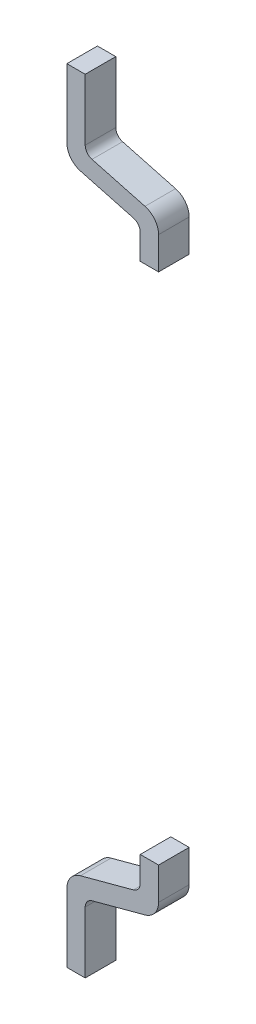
ISO-10303-21;
HEADER;
FILE_DESCRIPTION(('STEP AP214'),'2;1');
FILE_NAME('part.step','',(''),(''),'','','');
FILE_SCHEMA(('AUTOMOTIVE_DESIGN { 1 0 10303 214 1 1 1 1 }'));
ENDSEC;
DATA;
#1=APPLICATION_CONTEXT('core data for automotive mechanical design processes');
#2=APPLICATION_PROTOCOL_DEFINITION('international standard','automotive_design',2000,#1);
#3=PRODUCT_CONTEXT('',#1,'mechanical');
#4=PRODUCT('Part','Part','',(#3));
#5=PRODUCT_RELATED_PRODUCT_CATEGORY('part','',(#4));
#6=PRODUCT_DEFINITION_FORMATION('','',#4);
#7=PRODUCT_DEFINITION_CONTEXT('part definition',#1,'design');
#8=PRODUCT_DEFINITION('design','',#6,#7);
#9=PRODUCT_DEFINITION_SHAPE('','',#8);
#10=(LENGTH_UNIT() NAMED_UNIT(*) SI_UNIT(.MILLI.,.METRE.));
#11=(NAMED_UNIT(*) PLANE_ANGLE_UNIT() SI_UNIT($,.RADIAN.));
#12=(NAMED_UNIT(*) SI_UNIT($,.STERADIAN.) SOLID_ANGLE_UNIT());
#13=UNCERTAINTY_MEASURE_WITH_UNIT(LENGTH_MEASURE(1.E-05),#10,'distance_accuracy_value','');
#14=(GEOMETRIC_REPRESENTATION_CONTEXT(3) GLOBAL_UNCERTAINTY_ASSIGNED_CONTEXT((#13)) GLOBAL_UNIT_ASSIGNED_CONTEXT((#10,
#11,#12)) REPRESENTATION_CONTEXT('',''));
#15=CARTESIAN_POINT('',(0.,0.,0.));
#16=DIRECTION('',(0.,0.,1.));
#17=DIRECTION('',(1.,0.,0.));
#18=AXIS2_PLACEMENT_3D('',#15,#16,#17);
#19=CARTESIAN_POINT('',(0.319072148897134,-2.61868112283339,-3.45));
#20=DIRECTION('',(0.,0.,-1.));
#21=DIRECTION('',(-1.,0.,0.));
#22=AXIS2_PLACEMENT_3D('',#19,#20,#21);
#23=PLANE('',#22);
#24=DIRECTION('',(0.,1.,0.));
#25=VECTOR('',#24,1.);
#26=CARTESIAN_POINT('',(0.6,-2.30668096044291,-3.45));
#27=LINE('',#26,#25);
#28=CARTESIAN_POINT('',(0.6,-2.1,-3.45));
#29=VERTEX_POINT('',#28);
#30=CARTESIAN_POINT('',(0.6,-2.30668096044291,-3.45));
#31=VERTEX_POINT('',#30);
#32=EDGE_CURVE('P0_E125',#29,#31,#27,.F.);
#33=ORIENTED_EDGE('',*,*,#32,.T.);
#34=CARTESIAN_POINT('',(0.525,-2.30668096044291,-3.45));
#35=DIRECTION('',(0.,0.,-1.));
#36=DIRECTION('',(-1.,0.,0.));
#37=AXIS2_PLACEMENT_3D('',#34,#35,#36);
#38=CIRCLE('',#37,0.075);
#39=CARTESIAN_POINT('',(0.544411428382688,-2.37912539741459,-3.45));
#40=VERTEX_POINT('',#39);
#41=EDGE_CURVE('P0_E150',#31,#40,#38,.T.);
#42=ORIENTED_EDGE('',*,*,#41,.T.);
#43=DIRECTION('',(0.965925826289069,0.258819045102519,0.));
#44=VECTOR('',#43,1.);
#45=CARTESIAN_POINT('',(0.111177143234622,-2.49521017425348,-3.45));
#46=LINE('',#45,#44);
#47=CARTESIAN_POINT('',(0.111177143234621,-2.49521017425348,-3.45));
#48=VERTEX_POINT('',#47);
#49=EDGE_CURVE('P0_E156',#40,#48,#46,.F.);
#50=ORIENTED_EDGE('',*,*,#49,.T.);
#51=CARTESIAN_POINT('',(0.15,-2.64009904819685,-3.45));
#52=DIRECTION('',(0.,0.,-1.));
#53=DIRECTION('',(-1.,0.,0.));
#54=AXIS2_PLACEMENT_3D('',#51,#52,#53);
#55=CIRCLE('',#54,0.15);
#56=CARTESIAN_POINT('',(0.,-2.64009904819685,-3.45));
#57=VERTEX_POINT('',#56);
#58=EDGE_CURVE('P0_E154',#57,#48,#55,.T.);
#59=ORIENTED_EDGE('',*,*,#58,.F.);
#60=DIRECTION('',(0.,1.,0.));
#61=VECTOR('',#60,1.);
#62=CARTESIAN_POINT('',(0.,-3.2,-3.45));
#63=LINE('',#62,#61);
#64=CARTESIAN_POINT('',(0.,-3.2,-3.45));
#65=VERTEX_POINT('',#64);
#66=EDGE_CURVE('P0_E189',#57,#65,#63,.F.);
#67=ORIENTED_EDGE('',*,*,#66,.T.);
#68=DIRECTION('',(1.,0.,0.));
#69=VECTOR('',#68,1.);
#70=CARTESIAN_POINT('',(0.15,-3.2,-3.45));
#71=LINE('',#70,#69);
#72=CARTESIAN_POINT('',(0.15,-3.2,-3.45));
#73=VERTEX_POINT('',#72);
#74=EDGE_CURVE('P0_E195',#65,#73,#71,.T.);
#75=ORIENTED_EDGE('',*,*,#74,.T.);
#76=DIRECTION('',(0.,-1.,0.));
#77=VECTOR('',#76,1.);
#78=CARTESIAN_POINT('',(0.15,-2.69764857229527,-3.45));
#79=LINE('',#78,#77);
#80=CARTESIAN_POINT('',(0.15,-2.69764857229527,-3.45));
#81=VERTEX_POINT('',#80);
#82=EDGE_CURVE('P0_E163',#73,#81,#79,.F.);
#83=ORIENTED_EDGE('',*,*,#82,.T.);
#84=CARTESIAN_POINT('',(0.225,-2.69764857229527,-3.45));
#85=DIRECTION('',(0.,0.,-1.));
#86=DIRECTION('',(-1.,0.,0.));
#87=AXIS2_PLACEMENT_3D('',#84,#85,#86);
#88=CIRCLE('',#87,0.075);
#89=CARTESIAN_POINT('',(0.205588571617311,-2.62520413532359,-3.45));
#90=VERTEX_POINT('',#89);
#91=EDGE_CURVE('P0_E158',#81,#90,#88,.T.);
#92=ORIENTED_EDGE('',*,*,#91,.T.);
#93=DIRECTION('',(-0.965925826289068,-0.258819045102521,0.));
#94=VECTOR('',#93,1.);
#95=CARTESIAN_POINT('',(0.638822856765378,-2.50911935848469,-3.45));
#96=LINE('',#95,#94);
#97=CARTESIAN_POINT('',(0.638822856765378,-2.50911935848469,-3.45));
#98=VERTEX_POINT('',#97);
#99=EDGE_CURVE('P0_E165',#90,#98,#96,.F.);
#100=ORIENTED_EDGE('',*,*,#99,.T.);
#101=CARTESIAN_POINT('',(0.6,-2.36423048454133,-3.45));
#102=DIRECTION('',(0.,0.,-1.));
#103=DIRECTION('',(-1.,0.,0.));
#104=AXIS2_PLACEMENT_3D('',#101,#102,#103);
#105=CIRCLE('',#104,0.15);
#106=CARTESIAN_POINT('',(0.75,-2.36423048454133,-3.45));
#107=VERTEX_POINT('',#106);
#108=EDGE_CURVE('P0_E20',#107,#98,#105,.T.);
#109=ORIENTED_EDGE('',*,*,#108,.F.);
#110=DIRECTION('',(0.,-1.,0.));
#111=VECTOR('',#110,1.);
#112=CARTESIAN_POINT('',(0.75,-2.1,-3.45));
#113=LINE('',#112,#111);
#114=CARTESIAN_POINT('',(0.75,-2.1,-3.45));
#115=VERTEX_POINT('',#114);
#116=EDGE_CURVE('P0_E89',#107,#115,#113,.F.);
#117=ORIENTED_EDGE('',*,*,#116,.T.);
#118=DIRECTION('',(1.,0.,0.));
#119=VECTOR('',#118,1.);
#120=CARTESIAN_POINT('',(0.6,-2.1,-3.45));
#121=LINE('',#120,#119);
#122=EDGE_CURVE('P0_E181',#115,#29,#121,.F.);
#123=ORIENTED_EDGE('',*,*,#122,.T.);
#124=EDGE_LOOP('',(#33,#42,#50,#59,#67,#75,#83,#92,#100,#109,#117,#123));
#125=FACE_BOUND('',#124,.T.);
#126=ADVANCED_FACE('P0_F17',(#125),#23,.F.);
#127=CARTESIAN_POINT('',(0.6,-2.1,-3.575));
#128=DIRECTION('',(0.,-1.,0.));
#129=DIRECTION('',(0.,0.,-1.));
#130=AXIS2_PLACEMENT_3D('',#127,#128,#129);
#131=PLANE('',#130);
#132=DIRECTION('',(-1.,0.,0.));
#133=VECTOR('',#132,1.);
#134=CARTESIAN_POINT('',(0.319072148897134,-2.1,-3.7));
#135=LINE('',#134,#133);
#136=CARTESIAN_POINT('',(0.6,-2.1,-3.7));
#137=VERTEX_POINT('',#136);
#138=CARTESIAN_POINT('',(0.75,-2.1,-3.7));
#139=VERTEX_POINT('',#138);
#140=EDGE_CURVE('P0_E111',#137,#139,#135,.F.);
#141=ORIENTED_EDGE('',*,*,#140,.F.);
#142=DIRECTION('',(0.,0.,1.));
#143=VECTOR('',#142,1.);
#144=CARTESIAN_POINT('',(0.6,-2.1,-3.575));
#145=LINE('',#144,#143);
#146=EDGE_CURVE('P0_E114',#137,#29,#145,.T.);
#147=ORIENTED_EDGE('',*,*,#146,.T.);
#148=ORIENTED_EDGE('',*,*,#122,.F.);
#149=DIRECTION('',(0.,0.,1.));
#150=VECTOR('',#149,1.);
#151=CARTESIAN_POINT('',(0.75,-2.1,-3.575));
#152=LINE('',#151,#150);
#153=EDGE_CURVE('P0_E116',#115,#139,#152,.F.);
#154=ORIENTED_EDGE('',*,*,#153,.T.);
#155=EDGE_LOOP('',(#141,#147,#148,#154));
#156=FACE_BOUND('',#155,.T.);
#157=ADVANCED_FACE('P0_F113',(#156),#131,.F.);
#158=CARTESIAN_POINT('',(0.75,-2.1,-3.575));
#159=DIRECTION('',(-1.,0.,0.));
#160=DIRECTION('',(0.,-1.,0.));
#161=AXIS2_PLACEMENT_3D('',#158,#159,#160);
#162=PLANE('',#161);
#163=DIRECTION('',(0.,1.,0.));
#164=VECTOR('',#163,1.);
#165=CARTESIAN_POINT('',(0.75,-2.61868112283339,-3.7));
#166=LINE('',#165,#164);
#167=CARTESIAN_POINT('',(0.75,-2.36423048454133,-3.7));
#168=VERTEX_POINT('',#167);
#169=EDGE_CURVE('P0_E120',#139,#168,#166,.F.);
#170=ORIENTED_EDGE('',*,*,#169,.F.);
#171=ORIENTED_EDGE('',*,*,#153,.F.);
#172=ORIENTED_EDGE('',*,*,#116,.F.);
#173=DIRECTION('',(0.,0.,-1.));
#174=VECTOR('',#173,1.);
#175=CARTESIAN_POINT('',(0.75,-2.36423048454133,-3.575));
#176=LINE('',#175,#174);
#177=EDGE_CURVE('P0_E175',#168,#107,#176,.F.);
#178=ORIENTED_EDGE('',*,*,#177,.F.);
#179=EDGE_LOOP('',(#170,#171,#172,#178));
#180=FACE_BOUND('',#179,.T.);
#181=ADVANCED_FACE('P0_F256',(#180),#162,.F.);
#182=CARTESIAN_POINT('',(0.6,-2.36423048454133,-3.575));
#183=DIRECTION('',(0.,0.,-1.));
#184=DIRECTION('',(-1.,0.,0.));
#185=AXIS2_PLACEMENT_3D('',#182,#183,#184);
#186=CYLINDRICAL_SURFACE('',#185,0.15);
#187=ORIENTED_EDGE('',*,*,#177,.T.);
#188=ORIENTED_EDGE('',*,*,#108,.T.);
#189=DIRECTION('',(0.,0.,1.));
#190=VECTOR('',#189,1.);
#191=CARTESIAN_POINT('',(0.638822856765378,-2.50911935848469,-3.575));
#192=LINE('',#191,#190);
#193=CARTESIAN_POINT('',(0.638822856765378,-2.50911935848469,-3.7));
#194=VERTEX_POINT('',#193);
#195=EDGE_CURVE('P0_E160',#98,#194,#192,.F.);
#196=ORIENTED_EDGE('',*,*,#195,.T.);
#197=CARTESIAN_POINT('',(0.6,-2.36423048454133,-3.7));
#198=DIRECTION('',(0.,0.,-1.));
#199=DIRECTION('',(-1.,0.,0.));
#200=AXIS2_PLACEMENT_3D('',#197,#198,#199);
#201=CIRCLE('',#200,0.15);
#202=EDGE_CURVE('P0_E147',#168,#194,#201,.T.);
#203=ORIENTED_EDGE('',*,*,#202,.F.);
#204=EDGE_LOOP('',(#187,#188,#196,#203));
#205=FACE_BOUND('',#204,.T.);
#206=ADVANCED_FACE('P0_F257',(#205),#186,.T.);
#207=CARTESIAN_POINT('',(0.638822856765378,-2.50911935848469,-3.575));
#208=DIRECTION('',(-0.258819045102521,0.965925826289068,0.));
#209=DIRECTION('',(-0.965925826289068,-0.258819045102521,0.));
#210=AXIS2_PLACEMENT_3D('',#207,#208,#209);
#211=PLANE('',#210);
#212=DIRECTION('',(-0.965925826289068,-0.258819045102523,0.));
#213=VECTOR('',#212,1.);
#214=CARTESIAN_POINT('',(0.638822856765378,-2.50911935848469,-3.7));
#215=LINE('',#214,#213);
#216=CARTESIAN_POINT('',(0.205588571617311,-2.62520413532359,-3.7));
#217=VERTEX_POINT('',#216);
#218=EDGE_CURVE('P0_E146',#194,#217,#215,.T.);
#219=ORIENTED_EDGE('',*,*,#218,.F.);
#220=ORIENTED_EDGE('',*,*,#195,.F.);
#221=ORIENTED_EDGE('',*,*,#99,.F.);
#222=DIRECTION('',(0.,0.,-1.));
#223=VECTOR('',#222,1.);
#224=CARTESIAN_POINT('',(0.205588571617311,-2.62520413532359,-3.575));
#225=LINE('',#224,#223);
#226=EDGE_CURVE('P0_E159',#90,#217,#225,.T.);
#227=ORIENTED_EDGE('',*,*,#226,.T.);
#228=EDGE_LOOP('',(#219,#220,#221,#227));
#229=FACE_BOUND('',#228,.T.);
#230=ADVANCED_FACE('P0_F259',(#229),#211,.F.);
#231=CARTESIAN_POINT('',(0.225,-2.69764857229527,-3.575));
#232=DIRECTION('',(0.,0.,-1.));
#233=DIRECTION('',(-1.,0.,0.));
#234=AXIS2_PLACEMENT_3D('',#231,#232,#233);
#235=CYLINDRICAL_SURFACE('',#234,0.075);
#236=CARTESIAN_POINT('',(0.225,-2.69764857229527,-3.7));
#237=DIRECTION('',(0.,0.,-1.));
#238=DIRECTION('',(-1.,0.,0.));
#239=AXIS2_PLACEMENT_3D('',#236,#237,#238);
#240=CIRCLE('',#239,0.075);
#241=CARTESIAN_POINT('',(0.15,-2.69764857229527,-3.7));
#242=VERTEX_POINT('',#241);
#243=EDGE_CURVE('P0_E142',#217,#242,#240,.F.);
#244=ORIENTED_EDGE('',*,*,#243,.F.);
#245=ORIENTED_EDGE('',*,*,#226,.F.);
#246=ORIENTED_EDGE('',*,*,#91,.F.);
#247=DIRECTION('',(0.,0.,1.));
#248=VECTOR('',#247,1.);
#249=CARTESIAN_POINT('',(0.15,-2.69764857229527,-3.575));
#250=LINE('',#249,#248);
#251=EDGE_CURVE('P0_E197',#81,#242,#250,.F.);
#252=ORIENTED_EDGE('',*,*,#251,.T.);
#253=EDGE_LOOP('',(#244,#245,#246,#252));
#254=FACE_BOUND('',#253,.T.);
#255=ADVANCED_FACE('P0_F261',(#254),#235,.F.);
#256=CARTESIAN_POINT('',(0.15,-2.69764857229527,-3.575));
#257=DIRECTION('',(-1.,0.,0.));
#258=DIRECTION('',(0.,-1.,0.));
#259=AXIS2_PLACEMENT_3D('',#256,#257,#258);
#260=PLANE('',#259);
#261=DIRECTION('',(0.,1.,0.));
#262=VECTOR('',#261,1.);
#263=CARTESIAN_POINT('',(0.15,-2.61868112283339,-3.7));
#264=LINE('',#263,#262);
#265=CARTESIAN_POINT('',(0.15,-3.2,-3.7));
#266=VERTEX_POINT('',#265);
#267=EDGE_CURVE('P0_E145',#242,#266,#264,.F.);
#268=ORIENTED_EDGE('',*,*,#267,.F.);
#269=ORIENTED_EDGE('',*,*,#251,.F.);
#270=ORIENTED_EDGE('',*,*,#82,.F.);
#271=DIRECTION('',(0.,0.,1.));
#272=VECTOR('',#271,1.);
#273=CARTESIAN_POINT('',(0.15,-3.2,-3.575));
#274=LINE('',#273,#272);
#275=EDGE_CURVE('P0_E192',#73,#266,#274,.F.);
#276=ORIENTED_EDGE('',*,*,#275,.T.);
#277=EDGE_LOOP('',(#268,#269,#270,#276));
#278=FACE_BOUND('',#277,.T.);
#279=ADVANCED_FACE('P0_F263',(#278),#260,.F.);
#280=CARTESIAN_POINT('',(0.15,-3.2,-3.575));
#281=DIRECTION('',(0.,1.,0.));
#282=DIRECTION('',(0.,0.,1.));
#283=AXIS2_PLACEMENT_3D('',#280,#281,#282);
#284=PLANE('',#283);
#285=DIRECTION('',(-1.,0.,0.));
#286=VECTOR('',#285,1.);
#287=CARTESIAN_POINT('',(0.319072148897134,-3.2,-3.7));
#288=LINE('',#287,#286);
#289=CARTESIAN_POINT('',(0.,-3.2,-3.7));
#290=VERTEX_POINT('',#289);
#291=EDGE_CURVE('P0_E213',#266,#290,#288,.T.);
#292=ORIENTED_EDGE('',*,*,#291,.F.);
#293=ORIENTED_EDGE('',*,*,#275,.F.);
#294=ORIENTED_EDGE('',*,*,#74,.F.);
#295=DIRECTION('',(0.,0.,-1.));
#296=VECTOR('',#295,1.);
#297=CARTESIAN_POINT('',(0.,-3.2,-3.575));
#298=LINE('',#297,#296);
#299=EDGE_CURVE('P0_E191',#65,#290,#298,.T.);
#300=ORIENTED_EDGE('',*,*,#299,.T.);
#301=EDGE_LOOP('',(#292,#293,#294,#300));
#302=FACE_BOUND('',#301,.T.);
#303=ADVANCED_FACE('P0_F267',(#302),#284,.F.);
#304=CARTESIAN_POINT('',(0.,-3.2,-3.575));
#305=DIRECTION('',(1.,0.,0.));
#306=DIRECTION('',(0.,0.,-1.));
#307=AXIS2_PLACEMENT_3D('',#304,#305,#306);
#308=PLANE('',#307);
#309=DIRECTION('',(0.,1.,0.));
#310=VECTOR('',#309,1.);
#311=CARTESIAN_POINT('',(0.,-2.61868112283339,-3.7));
#312=LINE('',#311,#310);
#313=CARTESIAN_POINT('',(0.,-2.64009904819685,-3.7));
#314=VERTEX_POINT('',#313);
#315=EDGE_CURVE('P0_E141',#290,#314,#312,.T.);
#316=ORIENTED_EDGE('',*,*,#315,.F.);
#317=ORIENTED_EDGE('',*,*,#299,.F.);
#318=ORIENTED_EDGE('',*,*,#66,.F.);
#319=DIRECTION('',(0.,0.,-1.));
#320=VECTOR('',#319,1.);
#321=CARTESIAN_POINT('',(0.,-2.64009904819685,-3.575));
#322=LINE('',#321,#320);
#323=EDGE_CURVE('P0_E157',#314,#57,#322,.F.);
#324=ORIENTED_EDGE('',*,*,#323,.F.);
#325=EDGE_LOOP('',(#316,#317,#318,#324));
#326=FACE_BOUND('',#325,.T.);
#327=ADVANCED_FACE('P0_F247',(#326),#308,.F.);
#328=CARTESIAN_POINT('',(0.15,-2.64009904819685,-3.575));
#329=DIRECTION('',(0.,0.,-1.));
#330=DIRECTION('',(-1.,0.,0.));
#331=AXIS2_PLACEMENT_3D('',#328,#329,#330);
#332=CYLINDRICAL_SURFACE('',#331,0.15);
#333=ORIENTED_EDGE('',*,*,#323,.T.);
#334=ORIENTED_EDGE('',*,*,#58,.T.);
#335=DIRECTION('',(0.,0.,1.));
#336=VECTOR('',#335,1.);
#337=CARTESIAN_POINT('',(0.111177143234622,-2.49521017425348,-3.575));
#338=LINE('',#337,#336);
#339=CARTESIAN_POINT('',(0.111177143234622,-2.49521017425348,-3.7));
#340=VERTEX_POINT('',#339);
#341=EDGE_CURVE('P0_E153',#48,#340,#338,.F.);
#342=ORIENTED_EDGE('',*,*,#341,.T.);
#343=CARTESIAN_POINT('',(0.15,-2.64009904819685,-3.7));
#344=DIRECTION('',(0.,0.,-1.));
#345=DIRECTION('',(-1.,0.,0.));
#346=AXIS2_PLACEMENT_3D('',#343,#344,#345);
#347=CIRCLE('',#346,0.15);
#348=EDGE_CURVE('P0_E134',#314,#340,#347,.T.);
#349=ORIENTED_EDGE('',*,*,#348,.F.);
#350=EDGE_LOOP('',(#333,#334,#342,#349));
#351=FACE_BOUND('',#350,.T.);
#352=ADVANCED_FACE('P0_F250',(#351),#332,.T.);
#353=CARTESIAN_POINT('',(0.111177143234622,-2.49521017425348,-3.575));
#354=DIRECTION('',(0.258819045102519,-0.965925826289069,0.));
#355=DIRECTION('',(0.965925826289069,0.258819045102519,0.));
#356=AXIS2_PLACEMENT_3D('',#353,#354,#355);
#357=PLANE('',#356);
#358=DIRECTION('',(0.965925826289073,0.258819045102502,0.));
#359=VECTOR('',#358,1.);
#360=CARTESIAN_POINT('',(0.111177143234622,-2.49521017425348,-3.7));
#361=LINE('',#360,#359);
#362=CARTESIAN_POINT('',(0.544411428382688,-2.37912539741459,-3.7));
#363=VERTEX_POINT('',#362);
#364=EDGE_CURVE('P0_E131',#340,#363,#361,.T.);
#365=ORIENTED_EDGE('',*,*,#364,.F.);
#366=ORIENTED_EDGE('',*,*,#341,.F.);
#367=ORIENTED_EDGE('',*,*,#49,.F.);
#368=DIRECTION('',(0.,0.,-1.));
#369=VECTOR('',#368,1.);
#370=CARTESIAN_POINT('',(0.544411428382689,-2.37912539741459,-3.575));
#371=LINE('',#370,#369);
#372=EDGE_CURVE('P0_E152',#40,#363,#371,.T.);
#373=ORIENTED_EDGE('',*,*,#372,.T.);
#374=EDGE_LOOP('',(#365,#366,#367,#373));
#375=FACE_BOUND('',#374,.T.);
#376=ADVANCED_FACE('P0_F254',(#375),#357,.F.);
#377=CARTESIAN_POINT('',(0.525,-2.30668096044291,-3.575));
#378=DIRECTION('',(0.,0.,-1.));
#379=DIRECTION('',(-1.,0.,0.));
#380=AXIS2_PLACEMENT_3D('',#377,#378,#379);
#381=CYLINDRICAL_SURFACE('',#380,0.075);
#382=CARTESIAN_POINT('',(0.525,-2.30668096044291,-3.7));
#383=DIRECTION('',(0.,0.,-1.));
#384=DIRECTION('',(-1.,0.,0.));
#385=AXIS2_PLACEMENT_3D('',#382,#383,#384);
#386=CIRCLE('',#385,0.075);
#387=CARTESIAN_POINT('',(0.6,-2.30668096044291,-3.7));
#388=VERTEX_POINT('',#387);
#389=EDGE_CURVE('P0_E26',#363,#388,#386,.F.);
#390=ORIENTED_EDGE('',*,*,#389,.F.);
#391=ORIENTED_EDGE('',*,*,#372,.F.);
#392=ORIENTED_EDGE('',*,*,#41,.F.);
#393=DIRECTION('',(0.,0.,1.));
#394=VECTOR('',#393,1.);
#395=CARTESIAN_POINT('',(0.6,-2.30668096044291,-3.575));
#396=LINE('',#395,#394);
#397=EDGE_CURVE('P0_E35',#31,#388,#396,.F.);
#398=ORIENTED_EDGE('',*,*,#397,.T.);
#399=EDGE_LOOP('',(#390,#391,#392,#398));
#400=FACE_BOUND('',#399,.T.);
#401=ADVANCED_FACE('P0_F255',(#400),#381,.F.);
#402=CARTESIAN_POINT('',(0.6,-2.30668096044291,-3.575));
#403=DIRECTION('',(1.,0.,0.));
#404=DIRECTION('',(0.,1.,0.));
#405=AXIS2_PLACEMENT_3D('',#402,#403,#404);
#406=PLANE('',#405);
#407=DIRECTION('',(0.,1.,0.));
#408=VECTOR('',#407,1.);
#409=CARTESIAN_POINT('',(0.6,-2.61868112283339,-3.7));
#410=LINE('',#409,#408);
#411=EDGE_CURVE('P0_E11',#388,#137,#410,.T.);
#412=ORIENTED_EDGE('',*,*,#411,.F.);
#413=ORIENTED_EDGE('',*,*,#397,.F.);
#414=ORIENTED_EDGE('',*,*,#32,.F.);
#415=ORIENTED_EDGE('',*,*,#146,.F.);
#416=EDGE_LOOP('',(#412,#413,#414,#415));
#417=FACE_BOUND('',#416,.T.);
#418=ADVANCED_FACE('P0_F123',(#417),#406,.F.);
#419=CARTESIAN_POINT('',(0.319072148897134,-2.61868112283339,-3.7));
#420=DIRECTION('',(0.,0.,-1.));
#421=DIRECTION('',(-1.,0.,0.));
#422=AXIS2_PLACEMENT_3D('',#419,#420,#421);
#423=PLANE('',#422);
#424=ORIENTED_EDGE('',*,*,#389,.T.);
#425=ORIENTED_EDGE('',*,*,#411,.T.);
#426=ORIENTED_EDGE('',*,*,#140,.T.);
#427=ORIENTED_EDGE('',*,*,#169,.T.);
#428=ORIENTED_EDGE('',*,*,#202,.T.);
#429=ORIENTED_EDGE('',*,*,#218,.T.);
#430=ORIENTED_EDGE('',*,*,#243,.T.);
#431=ORIENTED_EDGE('',*,*,#267,.T.);
#432=ORIENTED_EDGE('',*,*,#291,.T.);
#433=ORIENTED_EDGE('',*,*,#315,.T.);
#434=ORIENTED_EDGE('',*,*,#348,.T.);
#435=ORIENTED_EDGE('',*,*,#364,.T.);
#436=EDGE_LOOP('',(#424,#425,#426,#427,#428,#429,#430,#431,#432,#433,#434,#435));
#437=FACE_BOUND('',#436,.T.);
#438=ADVANCED_FACE('P0_F127',(#437),#423,.T.);
#439=CLOSED_SHELL('',(#126,#157,#181,#206,#230,#255,#279,#303,#327,#352,#376,#401,#418,#438));
#440=MANIFOLD_SOLID_BREP('P0_B1',#439);
#441=CARTESIAN_POINT('',(0.319072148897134,2.61868112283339,-3.7));
#442=DIRECTION('',(0.,0.,1.));
#443=DIRECTION('',(1.,0.,0.));
#444=AXIS2_PLACEMENT_3D('',#441,#442,#443);
#445=PLANE('',#444);
#446=DIRECTION('',(0.,-1.,0.));
#447=VECTOR('',#446,1.);
#448=CARTESIAN_POINT('',(0.6,2.30668096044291,-3.7));
#449=LINE('',#448,#447);
#450=CARTESIAN_POINT('',(0.6,2.30668096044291,-3.7));
#451=VERTEX_POINT('',#450);
#452=CARTESIAN_POINT('',(0.6,2.1,-3.7));
#453=VERTEX_POINT('',#452);
#454=EDGE_CURVE('P1_E102',#451,#453,#449,.T.);
#455=ORIENTED_EDGE('',*,*,#454,.F.);
#456=CARTESIAN_POINT('',(0.525,2.30668096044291,-3.7));
#457=DIRECTION('',(0.,0.,1.));
#458=DIRECTION('',(1.,0.,0.));
#459=AXIS2_PLACEMENT_3D('',#456,#457,#458);
#460=CIRCLE('',#459,0.075);
#461=CARTESIAN_POINT('',(0.544411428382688,2.37912539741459,-3.7));
#462=VERTEX_POINT('',#461);
#463=EDGE_CURVE('P1_E130',#451,#462,#460,.T.);
#464=ORIENTED_EDGE('',*,*,#463,.T.);
#465=DIRECTION('',(0.965925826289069,-0.258819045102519,0.));
#466=VECTOR('',#465,1.);
#467=CARTESIAN_POINT('',(0.111177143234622,2.49521017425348,-3.7));
#468=LINE('',#467,#466);
#469=CARTESIAN_POINT('',(0.111177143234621,2.49521017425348,-3.7));
#470=VERTEX_POINT('',#469);
#471=EDGE_CURVE('P1_E127',#470,#462,#468,.T.);
#472=ORIENTED_EDGE('',*,*,#471,.F.);
#473=CARTESIAN_POINT('',(0.15,2.64009904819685,-3.7));
#474=DIRECTION('',(0.,0.,1.));
#475=DIRECTION('',(1.,0.,0.));
#476=AXIS2_PLACEMENT_3D('',#473,#474,#475);
#477=CIRCLE('',#476,0.15);
#478=CARTESIAN_POINT('',(0.,2.64009904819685,-3.7));
#479=VERTEX_POINT('',#478);
#480=EDGE_CURVE('P1_E175',#479,#470,#477,.T.);
#481=ORIENTED_EDGE('',*,*,#480,.F.);
#482=DIRECTION('',(0.,1.,0.));
#483=VECTOR('',#482,1.);
#484=CARTESIAN_POINT('',(0.,3.2,-3.7));
#485=LINE('',#484,#483);
#486=CARTESIAN_POINT('',(0.,3.2,-3.7));
#487=VERTEX_POINT('',#486);
#488=EDGE_CURVE('P1_E132',#487,#479,#485,.F.);
#489=ORIENTED_EDGE('',*,*,#488,.F.);
#490=DIRECTION('',(1.,0.,0.));
#491=VECTOR('',#490,1.);
#492=CARTESIAN_POINT('',(0.15,3.2,-3.7));
#493=LINE('',#492,#491);
#494=CARTESIAN_POINT('',(0.15,3.2,-3.7));
#495=VERTEX_POINT('',#494);
#496=EDGE_CURVE('P1_E138',#495,#487,#493,.F.);
#497=ORIENTED_EDGE('',*,*,#496,.F.);
#498=DIRECTION('',(0.,1.,0.));
#499=VECTOR('',#498,1.);
#500=CARTESIAN_POINT('',(0.15,2.69764857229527,-3.7));
#501=LINE('',#500,#499);
#502=CARTESIAN_POINT('',(0.15,2.69764857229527,-3.7));
#503=VERTEX_POINT('',#502);
#504=EDGE_CURVE('P1_E144',#503,#495,#501,.T.);
#505=ORIENTED_EDGE('',*,*,#504,.F.);
#506=CARTESIAN_POINT('',(0.225,2.69764857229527,-3.7));
#507=DIRECTION('',(0.,0.,1.));
#508=DIRECTION('',(1.,0.,0.));
#509=AXIS2_PLACEMENT_3D('',#506,#507,#508);
#510=CIRCLE('',#509,0.075);
#511=CARTESIAN_POINT('',(0.205588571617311,2.62520413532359,-3.7));
#512=VERTEX_POINT('',#511);
#513=EDGE_CURVE('P1_E153',#503,#512,#510,.T.);
#514=ORIENTED_EDGE('',*,*,#513,.T.);
#515=DIRECTION('',(-0.965925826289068,0.258819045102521,0.));
#516=VECTOR('',#515,1.);
#517=CARTESIAN_POINT('',(0.638822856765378,2.50911935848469,-3.7));
#518=LINE('',#517,#516);
#519=CARTESIAN_POINT('',(0.638822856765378,2.50911935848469,-3.7));
#520=VERTEX_POINT('',#519);
#521=EDGE_CURVE('P1_E150',#520,#512,#518,.T.);
#522=ORIENTED_EDGE('',*,*,#521,.F.);
#523=CARTESIAN_POINT('',(0.6,2.36423048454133,-3.7));
#524=DIRECTION('',(0.,0.,1.));
#525=DIRECTION('',(1.,0.,0.));
#526=AXIS2_PLACEMENT_3D('',#523,#524,#525);
#527=CIRCLE('',#526,0.15);
#528=CARTESIAN_POINT('',(0.75,2.36423048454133,-3.7));
#529=VERTEX_POINT('',#528);
#530=EDGE_CURVE('P1_E19',#529,#520,#527,.T.);
#531=ORIENTED_EDGE('',*,*,#530,.F.);
#532=DIRECTION('',(0.,1.,0.));
#533=VECTOR('',#532,1.);
#534=CARTESIAN_POINT('',(0.75,2.1,-3.7));
#535=LINE('',#534,#533);
#536=CARTESIAN_POINT('',(0.75,2.1,-3.7));
#537=VERTEX_POINT('',#536);
#538=EDGE_CURVE('P1_E87',#537,#529,#535,.T.);
#539=ORIENTED_EDGE('',*,*,#538,.F.);
#540=DIRECTION('',(1.,0.,0.));
#541=VECTOR('',#540,1.);
#542=CARTESIAN_POINT('',(0.6,2.1,-3.7));
#543=LINE('',#542,#541);
#544=EDGE_CURVE('P1_E96',#453,#537,#543,.T.);
#545=ORIENTED_EDGE('',*,*,#544,.F.);
#546=EDGE_LOOP('',(#455,#464,#472,#481,#489,#497,#505,#514,#522,#531,#539,#545));
#547=FACE_BOUND('',#546,.T.);
#548=ADVANCED_FACE('P1_F16',(#547),#445,.F.);
#549=CARTESIAN_POINT('',(0.6,2.1,-3.575));
#550=DIRECTION('',(0.,-1.,0.));
#551=DIRECTION('',(0.,0.,-1.));
#552=AXIS2_PLACEMENT_3D('',#549,#550,#551);
#553=PLANE('',#552);
#554=DIRECTION('',(0.,0.,1.));
#555=VECTOR('',#554,1.);
#556=CARTESIAN_POINT('',(0.6,2.1,-3.575));
#557=LINE('',#556,#555);
#558=CARTESIAN_POINT('',(0.6,2.1,-3.45));
#559=VERTEX_POINT('',#558);
#560=EDGE_CURVE('P1_E107',#453,#559,#557,.T.);
#561=ORIENTED_EDGE('',*,*,#560,.F.);
#562=ORIENTED_EDGE('',*,*,#544,.T.);
#563=DIRECTION('',(0.,0.,1.));
#564=VECTOR('',#563,1.);
#565=CARTESIAN_POINT('',(0.75,2.1,-3.575));
#566=LINE('',#565,#564);
#567=CARTESIAN_POINT('',(0.75,2.1,-3.45));
#568=VERTEX_POINT('',#567);
#569=EDGE_CURVE('P1_E103',#568,#537,#566,.F.);
#570=ORIENTED_EDGE('',*,*,#569,.F.);
#571=DIRECTION('',(1.,0.,0.));
#572=VECTOR('',#571,1.);
#573=CARTESIAN_POINT('',(0.319072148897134,2.1,-3.45));
#574=LINE('',#573,#572);
#575=EDGE_CURVE('P1_E110',#559,#568,#574,.T.);
#576=ORIENTED_EDGE('',*,*,#575,.F.);
#577=EDGE_LOOP('',(#561,#562,#570,#576));
#578=FACE_BOUND('',#577,.T.);
#579=ADVANCED_FACE('P1_F108',(#578),#553,.T.);
#580=CARTESIAN_POINT('',(0.75,2.1,-3.575));
#581=DIRECTION('',(1.,0.,0.));
#582=DIRECTION('',(0.,1.,0.));
#583=AXIS2_PLACEMENT_3D('',#580,#581,#582);
#584=PLANE('',#583);
#585=ORIENTED_EDGE('',*,*,#569,.T.);
#586=ORIENTED_EDGE('',*,*,#538,.T.);
#587=DIRECTION('',(0.,0.,1.));
#588=VECTOR('',#587,1.);
#589=CARTESIAN_POINT('',(0.75,2.36423048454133,-3.575));
#590=LINE('',#589,#588);
#591=CARTESIAN_POINT('',(0.75,2.36423048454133,-3.45));
#592=VERTEX_POINT('',#591);
#593=EDGE_CURVE('P1_E156',#592,#529,#590,.F.);
#594=ORIENTED_EDGE('',*,*,#593,.F.);
#595=DIRECTION('',(0.,1.,0.));
#596=VECTOR('',#595,1.);
#597=CARTESIAN_POINT('',(0.75,2.61868112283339,-3.45));
#598=LINE('',#597,#596);
#599=EDGE_CURVE('P1_E116',#568,#592,#598,.T.);
#600=ORIENTED_EDGE('',*,*,#599,.F.);
#601=EDGE_LOOP('',(#585,#586,#594,#600));
#602=FACE_BOUND('',#601,.T.);
#603=ADVANCED_FACE('P1_F192',(#602),#584,.T.);
#604=CARTESIAN_POINT('',(0.6,2.36423048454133,-3.575));
#605=DIRECTION('',(0.,0.,1.));
#606=DIRECTION('',(1.,0.,0.));
#607=AXIS2_PLACEMENT_3D('',#604,#605,#606);
#608=CYLINDRICAL_SURFACE('',#607,0.15);
#609=ORIENTED_EDGE('',*,*,#593,.T.);
#610=ORIENTED_EDGE('',*,*,#530,.T.);
#611=DIRECTION('',(0.,0.,1.));
#612=VECTOR('',#611,1.);
#613=CARTESIAN_POINT('',(0.638822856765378,2.50911935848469,-3.575));
#614=LINE('',#613,#612);
#615=CARTESIAN_POINT('',(0.638822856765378,2.50911935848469,-3.45));
#616=VERTEX_POINT('',#615);
#617=EDGE_CURVE('P1_E154',#616,#520,#614,.F.);
#618=ORIENTED_EDGE('',*,*,#617,.F.);
#619=CARTESIAN_POINT('',(0.6,2.36423048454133,-3.45));
#620=DIRECTION('',(0.,0.,1.));
#621=DIRECTION('',(1.,0.,0.));
#622=AXIS2_PLACEMENT_3D('',#619,#620,#621);
#623=CIRCLE('',#622,0.15);
#624=EDGE_CURVE('P1_E171',#592,#616,#623,.T.);
#625=ORIENTED_EDGE('',*,*,#624,.F.);
#626=EDGE_LOOP('',(#609,#610,#618,#625));
#627=FACE_BOUND('',#626,.T.);
#628=ADVANCED_FACE('P1_F344',(#627),#608,.T.);
#629=CARTESIAN_POINT('',(0.638822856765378,2.50911935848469,-3.575));
#630=DIRECTION('',(0.258819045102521,0.965925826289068,0.));
#631=DIRECTION('',(-0.965925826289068,0.258819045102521,0.));
#632=AXIS2_PLACEMENT_3D('',#629,#630,#631);
#633=PLANE('',#632);
#634=ORIENTED_EDGE('',*,*,#617,.T.);
#635=ORIENTED_EDGE('',*,*,#521,.T.);
#636=DIRECTION('',(0.,0.,1.));
#637=VECTOR('',#636,1.);
#638=CARTESIAN_POINT('',(0.205588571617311,2.62520413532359,-3.575));
#639=LINE('',#638,#637);
#640=CARTESIAN_POINT('',(0.205588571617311,2.62520413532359,-3.45));
#641=VERTEX_POINT('',#640);
#642=EDGE_CURVE('P1_E176',#512,#641,#639,.T.);
#643=ORIENTED_EDGE('',*,*,#642,.T.);
#644=DIRECTION('',(-0.965925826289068,0.258819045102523,0.));
#645=VECTOR('',#644,1.);
#646=CARTESIAN_POINT('',(0.638822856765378,2.50911935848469,-3.45));
#647=LINE('',#646,#645);
#648=EDGE_CURVE('P1_E170',#616,#641,#647,.T.);
#649=ORIENTED_EDGE('',*,*,#648,.F.);
#650=EDGE_LOOP('',(#634,#635,#643,#649));
#651=FACE_BOUND('',#650,.T.);
#652=ADVANCED_FACE('P1_F334',(#651),#633,.T.);
#653=CARTESIAN_POINT('',(0.225,2.69764857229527,-3.575));
#654=DIRECTION('',(0.,0.,1.));
#655=DIRECTION('',(1.,0.,0.));
#656=AXIS2_PLACEMENT_3D('',#653,#654,#655);
#657=CYLINDRICAL_SURFACE('',#656,0.075);
#658=CARTESIAN_POINT('',(0.225,2.69764857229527,-3.45));
#659=DIRECTION('',(0.,0.,1.));
#660=DIRECTION('',(1.,0.,0.));
#661=AXIS2_PLACEMENT_3D('',#658,#659,#660);
#662=CIRCLE('',#661,0.075);
#663=CARTESIAN_POINT('',(0.15,2.69764857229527,-3.45));
#664=VERTEX_POINT('',#663);
#665=EDGE_CURVE('P1_E166',#641,#664,#662,.F.);
#666=ORIENTED_EDGE('',*,*,#665,.F.);
#667=ORIENTED_EDGE('',*,*,#642,.F.);
#668=ORIENTED_EDGE('',*,*,#513,.F.);
#669=DIRECTION('',(0.,0.,1.));
#670=VECTOR('',#669,1.);
#671=CARTESIAN_POINT('',(0.15,2.69764857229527,-3.575));
#672=LINE('',#671,#670);
#673=EDGE_CURVE('P1_E147',#664,#503,#672,.F.);
#674=ORIENTED_EDGE('',*,*,#673,.F.);
#675=EDGE_LOOP('',(#666,#667,#668,#674));
#676=FACE_BOUND('',#675,.T.);
#677=ADVANCED_FACE('P1_F325',(#676),#657,.F.);
#678=CARTESIAN_POINT('',(0.15,2.69764857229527,-3.575));
#679=DIRECTION('',(1.,0.,0.));
#680=DIRECTION('',(0.,1.,0.));
#681=AXIS2_PLACEMENT_3D('',#678,#679,#680);
#682=PLANE('',#681);
#683=ORIENTED_EDGE('',*,*,#673,.T.);
#684=ORIENTED_EDGE('',*,*,#504,.T.);
#685=DIRECTION('',(0.,0.,1.));
#686=VECTOR('',#685,1.);
#687=CARTESIAN_POINT('',(0.15,3.2,-3.575));
#688=LINE('',#687,#686);
#689=CARTESIAN_POINT('',(0.15,3.2,-3.45));
#690=VERTEX_POINT('',#689);
#691=EDGE_CURVE('P1_E141',#690,#495,#688,.F.);
#692=ORIENTED_EDGE('',*,*,#691,.F.);
#693=DIRECTION('',(0.,1.,0.));
#694=VECTOR('',#693,1.);
#695=CARTESIAN_POINT('',(0.15,2.61868112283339,-3.45));
#696=LINE('',#695,#694);
#697=EDGE_CURVE('P1_E169',#664,#690,#696,.T.);
#698=ORIENTED_EDGE('',*,*,#697,.F.);
#699=EDGE_LOOP('',(#683,#684,#692,#698));
#700=FACE_BOUND('',#699,.T.);
#701=ADVANCED_FACE('P1_F202',(#700),#682,.T.);
#702=CARTESIAN_POINT('',(0.15,3.2,-3.575));
#703=DIRECTION('',(0.,1.,0.));
#704=DIRECTION('',(0.,0.,1.));
#705=AXIS2_PLACEMENT_3D('',#702,#703,#704);
#706=PLANE('',#705);
#707=ORIENTED_EDGE('',*,*,#691,.T.);
#708=ORIENTED_EDGE('',*,*,#496,.T.);
#709=DIRECTION('',(0.,0.,1.));
#710=VECTOR('',#709,1.);
#711=CARTESIAN_POINT('',(0.,3.2,-3.575));
#712=LINE('',#711,#710);
#713=CARTESIAN_POINT('',(0.,3.2,-3.45));
#714=VERTEX_POINT('',#713);
#715=EDGE_CURVE('P1_E135',#714,#487,#712,.F.);
#716=ORIENTED_EDGE('',*,*,#715,.F.);
#717=DIRECTION('',(1.,0.,0.));
#718=VECTOR('',#717,1.);
#719=CARTESIAN_POINT('',(0.319072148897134,3.2,-3.45));
#720=LINE('',#719,#718);
#721=EDGE_CURVE('P1_E212',#690,#714,#720,.F.);
#722=ORIENTED_EDGE('',*,*,#721,.F.);
#723=EDGE_LOOP('',(#707,#708,#716,#722));
#724=FACE_BOUND('',#723,.T.);
#725=ADVANCED_FACE('P1_F210',(#724),#706,.T.);
#726=CARTESIAN_POINT('',(0.,3.2,-3.575));
#727=DIRECTION('',(-1.,0.,0.));
#728=DIRECTION('',(0.,0.,1.));
#729=AXIS2_PLACEMENT_3D('',#726,#727,#728);
#730=PLANE('',#729);
#731=ORIENTED_EDGE('',*,*,#715,.T.);
#732=ORIENTED_EDGE('',*,*,#488,.T.);
#733=DIRECTION('',(0.,0.,1.));
#734=VECTOR('',#733,1.);
#735=CARTESIAN_POINT('',(0.,2.64009904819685,-3.575));
#736=LINE('',#735,#734);
#737=CARTESIAN_POINT('',(0.,2.64009904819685,-3.45));
#738=VERTEX_POINT('',#737);
#739=EDGE_CURVE('P1_E134',#738,#479,#736,.F.);
#740=ORIENTED_EDGE('',*,*,#739,.F.);
#741=DIRECTION('',(0.,1.,0.));
#742=VECTOR('',#741,1.);
#743=CARTESIAN_POINT('',(0.,2.61868112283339,-3.45));
#744=LINE('',#743,#742);
#745=EDGE_CURVE('P1_E165',#714,#738,#744,.F.);
#746=ORIENTED_EDGE('',*,*,#745,.F.);
#747=EDGE_LOOP('',(#731,#732,#740,#746));
#748=FACE_BOUND('',#747,.T.);
#749=ADVANCED_FACE('P1_F298',(#748),#730,.T.);
#750=CARTESIAN_POINT('',(0.15,2.64009904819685,-3.575));
#751=DIRECTION('',(0.,0.,1.));
#752=DIRECTION('',(1.,0.,0.));
#753=AXIS2_PLACEMENT_3D('',#750,#751,#752);
#754=CYLINDRICAL_SURFACE('',#753,0.15);
#755=ORIENTED_EDGE('',*,*,#739,.T.);
#756=ORIENTED_EDGE('',*,*,#480,.T.);
#757=DIRECTION('',(0.,0.,1.));
#758=VECTOR('',#757,1.);
#759=CARTESIAN_POINT('',(0.111177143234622,2.49521017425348,-3.575));
#760=LINE('',#759,#758);
#761=CARTESIAN_POINT('',(0.111177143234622,2.49521017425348,-3.45));
#762=VERTEX_POINT('',#761);
#763=EDGE_CURVE('P1_E131',#762,#470,#760,.F.);
#764=ORIENTED_EDGE('',*,*,#763,.F.);
#765=CARTESIAN_POINT('',(0.15,2.64009904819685,-3.45));
#766=DIRECTION('',(0.,0.,1.));
#767=DIRECTION('',(1.,0.,0.));
#768=AXIS2_PLACEMENT_3D('',#765,#766,#767);
#769=CIRCLE('',#768,0.15);
#770=EDGE_CURVE('P1_E162',#738,#762,#769,.T.);
#771=ORIENTED_EDGE('',*,*,#770,.F.);
#772=EDGE_LOOP('',(#755,#756,#764,#771));
#773=FACE_BOUND('',#772,.T.);
#774=ADVANCED_FACE('P1_F264',(#773),#754,.T.);
#775=CARTESIAN_POINT('',(0.111177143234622,2.49521017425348,-3.575));
#776=DIRECTION('',(-0.258819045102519,-0.965925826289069,0.));
#777=DIRECTION('',(0.965925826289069,-0.258819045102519,0.));
#778=AXIS2_PLACEMENT_3D('',#775,#776,#777);
#779=PLANE('',#778);
#780=ORIENTED_EDGE('',*,*,#763,.T.);
#781=ORIENTED_EDGE('',*,*,#471,.T.);
#782=DIRECTION('',(0.,0.,1.));
#783=VECTOR('',#782,1.);
#784=CARTESIAN_POINT('',(0.544411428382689,2.37912539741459,-3.575));
#785=LINE('',#784,#783);
#786=CARTESIAN_POINT('',(0.544411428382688,2.37912539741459,-3.45));
#787=VERTEX_POINT('',#786);
#788=EDGE_CURVE('P1_E112',#462,#787,#785,.T.);
#789=ORIENTED_EDGE('',*,*,#788,.T.);
#790=DIRECTION('',(0.965925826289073,-0.258819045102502,0.));
#791=VECTOR('',#790,1.);
#792=CARTESIAN_POINT('',(0.111177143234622,2.49521017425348,-3.45));
#793=LINE('',#792,#791);
#794=EDGE_CURVE('P1_E161',#762,#787,#793,.T.);
#795=ORIENTED_EDGE('',*,*,#794,.F.);
#796=EDGE_LOOP('',(#780,#781,#789,#795));
#797=FACE_BOUND('',#796,.T.);
#798=ADVANCED_FACE('P1_F252',(#797),#779,.T.);
#799=CARTESIAN_POINT('',(0.525,2.30668096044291,-3.575));
#800=DIRECTION('',(0.,0.,1.));
#801=DIRECTION('',(1.,0.,0.));
#802=AXIS2_PLACEMENT_3D('',#799,#800,#801);
#803=CYLINDRICAL_SURFACE('',#802,0.075);
#804=CARTESIAN_POINT('',(0.525,2.30668096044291,-3.45));
#805=DIRECTION('',(0.,0.,1.));
#806=DIRECTION('',(1.,0.,0.));
#807=AXIS2_PLACEMENT_3D('',#804,#805,#806);
#808=CIRCLE('',#807,0.075);
#809=CARTESIAN_POINT('',(0.6,2.30668096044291,-3.45));
#810=VERTEX_POINT('',#809);
#811=EDGE_CURVE('P1_E25',#787,#810,#808,.F.);
#812=ORIENTED_EDGE('',*,*,#811,.F.);
#813=ORIENTED_EDGE('',*,*,#788,.F.);
#814=ORIENTED_EDGE('',*,*,#463,.F.);
#815=DIRECTION('',(0.,0.,1.));
#816=VECTOR('',#815,1.);
#817=CARTESIAN_POINT('',(0.6,2.30668096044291,-3.575));
#818=LINE('',#817,#816);
#819=EDGE_CURVE('P1_E34',#810,#451,#818,.F.);
#820=ORIENTED_EDGE('',*,*,#819,.F.);
#821=EDGE_LOOP('',(#812,#813,#814,#820));
#822=FACE_BOUND('',#821,.T.);
#823=ADVANCED_FACE('P1_F255',(#822),#803,.F.);
#824=CARTESIAN_POINT('',(0.6,2.30668096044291,-3.575));
#825=DIRECTION('',(-1.,0.,0.));
#826=DIRECTION('',(0.,-1.,0.));
#827=AXIS2_PLACEMENT_3D('',#824,#825,#826);
#828=PLANE('',#827);
#829=ORIENTED_EDGE('',*,*,#819,.T.);
#830=ORIENTED_EDGE('',*,*,#454,.T.);
#831=ORIENTED_EDGE('',*,*,#560,.T.);
#832=DIRECTION('',(0.,1.,0.));
#833=VECTOR('',#832,1.);
#834=CARTESIAN_POINT('',(0.6,2.61868112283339,-3.45));
#835=LINE('',#834,#833);
#836=EDGE_CURVE('P1_E10',#810,#559,#835,.F.);
#837=ORIENTED_EDGE('',*,*,#836,.F.);
#838=EDGE_LOOP('',(#829,#830,#831,#837));
#839=FACE_BOUND('',#838,.T.);
#840=ADVANCED_FACE('P1_F114',(#839),#828,.T.);
#841=CARTESIAN_POINT('',(0.319072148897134,2.61868112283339,-3.45));
#842=DIRECTION('',(0.,0.,1.));
#843=DIRECTION('',(1.,0.,0.));
#844=AXIS2_PLACEMENT_3D('',#841,#842,#843);
#845=PLANE('',#844);
#846=ORIENTED_EDGE('',*,*,#811,.T.);
#847=ORIENTED_EDGE('',*,*,#836,.T.);
#848=ORIENTED_EDGE('',*,*,#575,.T.);
#849=ORIENTED_EDGE('',*,*,#599,.T.);
#850=ORIENTED_EDGE('',*,*,#624,.T.);
#851=ORIENTED_EDGE('',*,*,#648,.T.);
#852=ORIENTED_EDGE('',*,*,#665,.T.);
#853=ORIENTED_EDGE('',*,*,#697,.T.);
#854=ORIENTED_EDGE('',*,*,#721,.T.);
#855=ORIENTED_EDGE('',*,*,#745,.T.);
#856=ORIENTED_EDGE('',*,*,#770,.T.);
#857=ORIENTED_EDGE('',*,*,#794,.T.);
#858=EDGE_LOOP('',(#846,#847,#848,#849,#850,#851,#852,#853,#854,#855,#856,#857));
#859=FACE_BOUND('',#858,.T.);
#860=ADVANCED_FACE('P1_F249',(#859),#845,.T.);
#861=CLOSED_SHELL('',(#548,#579,#603,#628,#652,#677,#701,#725,#749,#774,#798,#823,#840,#860));
#862=MANIFOLD_SOLID_BREP('P1_B1',#861);
#863=ADVANCED_BREP_SHAPE_REPRESENTATION('',(#18,#440,#862),#14);
#864=SHAPE_DEFINITION_REPRESENTATION(#9,#863);
ENDSEC;
END-ISO-10303-21;
